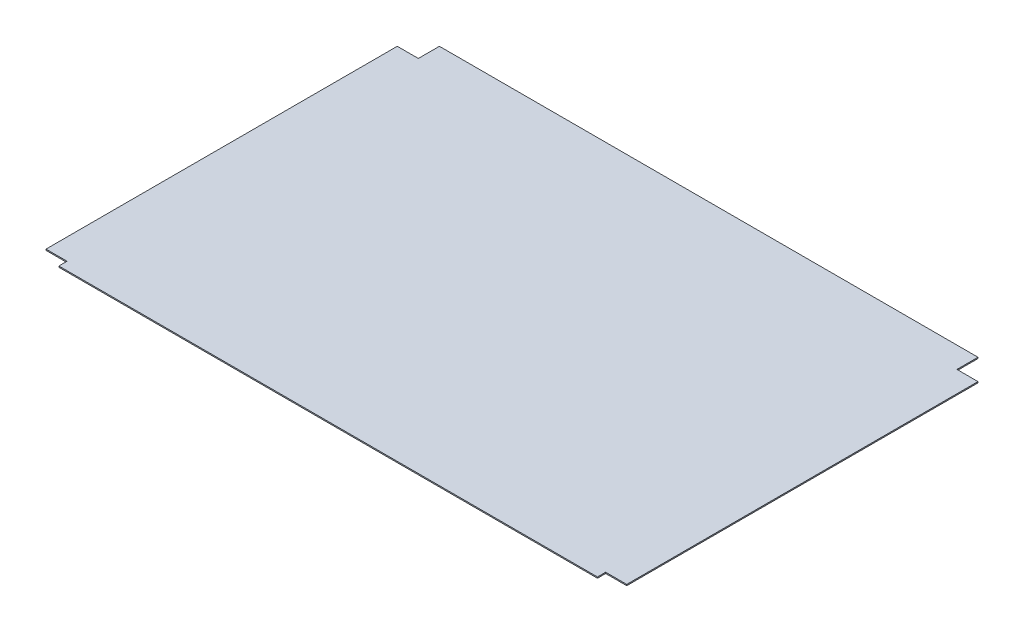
from build123d import *

# Parameters (mm, degrees)
SKETCH1_W               = 629.92
SKETCH1_H               = 426.72
EXTRUDE1_DEPTH          = 1.27
SKETCH2_W               = 22.86
SKETCH2_H               = 22.86
EXTRUDE2_DEPTH          = 381.425950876
MIRROR2_COPY_1_SKETCH_W = 22.86
MIRROR2_COPY_1_SKETCH_H = 22.86
MIRROR2_COPY_1_DEPTH    = 381.425950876
SKETCH3_W               = 584.2
SKETCH3_H               = 1.27
EXTRUDE3_DEPTH          = 13.97


with BuildPart() as part:
    # Sketch1 → Extrude1 (new body)
    with BuildSketch(Plane(origin=(0, 0, 0), x_dir=(1, 0, 0), z_dir=(0, 1, 0))):
        Rectangle(SKETCH1_W, SKETCH1_H)
    extrude(amount=EXTRUDE1_DEPTH)

    # Sketch2 → Extrude2 (cut, through all)
    with BuildSketch(Plane(origin=(0, 1.27, 0), x_dir=(1, 0, 0), z_dir=(0, 1, 0))):
        with Locations((-303.53, -201.93)):
            Rectangle(SKETCH2_W, SKETCH2_H)
    extrude2 = extrude(amount=-EXTRUDE2_DEPTH, mode=Mode.SUBTRACT)

    # Mirror1: Extrude2 across plane
    add(extrude2.mirror(Plane(origin=(0, 0, 0), x_dir=(0, 0, 1), z_dir=(1, 0, 0))), mode=Mode.SUBTRACT)

    # Mirror2: Extrude2 across plane
    add(extrude2.mirror(Plane.XY), mode=Mode.SUBTRACT)

    # Mirror2 copy 1 sketch → Mirror2 copy 1 (cut, through all)
    with BuildSketch(Plane(origin=(0, 1.27, 0), x_dir=(-1, 0, 0), z_dir=(0, 1, 0))):
        with Locations((-303.53, -201.93)):
            Rectangle(MIRROR2_COPY_1_SKETCH_W, MIRROR2_COPY_1_SKETCH_H)
    extrude(amount=-MIRROR2_COPY_1_DEPTH, mode=Mode.SUBTRACT)

    # Sketch3 → Extrude3 (cut)
    with BuildSketch(Plane.XY.offset(213.36)):
        with Locations((0, 0.635)):
            Rectangle(SKETCH3_W, SKETCH3_H)
    extrude(amount=-EXTRUDE3_DEPTH, mode=Mode.SUBTRACT)


solid = part.part
